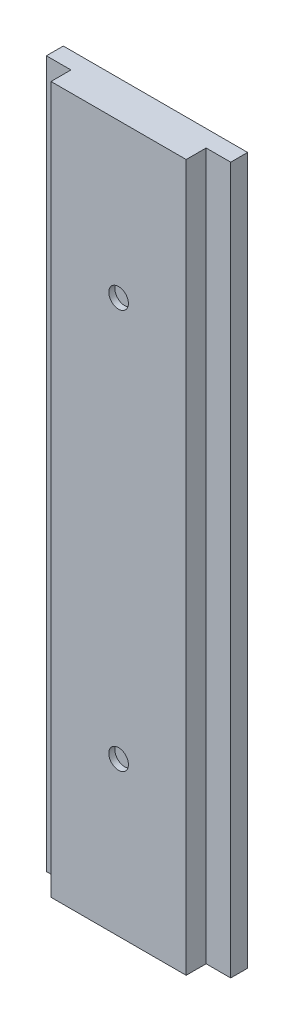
from build123d import *

# Parameters (mm, degrees)
ESQUISSE1_W             = 30
ESQUISSE1_H             = 115
EXTRUSION1_DEPTH        = 6
ESQUISSE2_W             = 4
ESQUISSE2_H             = 115
ENL_V_MAT_EXTRU_1_DEPTH = 3.25
ESQUISSE3_R             = 1.6
ENL_V_MAT_EXTRU_2_DEPTH = 1


with BuildPart() as part:
    # Esquisse1 → Extrusion1 (new body)
    with BuildSketch(Plane.XY):
        with Locations((35, -17.5)):
            Rectangle(ESQUISSE1_W, ESQUISSE1_H)
    extrude(amount=EXTRUSION1_DEPTH)

    # Esquisse2 → Enl_v. mat.-Extru.1 (cut)
    with BuildSketch(Plane.XY.offset(6)):
        with Locations((22, -17.5)):
            Rectangle(ESQUISSE2_W, ESQUISSE2_H)
        with Locations((48, -17.5)):
            Rectangle(ESQUISSE2_W, ESQUISSE2_H)
    extrude(amount=-ENL_V_MAT_EXTRU_1_DEPTH, mode=Mode.SUBTRACT)

    # Esquisse3 → Enl_v. mat.-Extru.2 (cut)
    with BuildSketch(Plane.XY.offset(6)):
        with Locations((35, 15)):
            Circle(ESQUISSE3_R)
        with Locations((35, -50)):
            Circle(ESQUISSE3_R)
    extrude(amount=-ENL_V_MAT_EXTRU_2_DEPTH, mode=Mode.SUBTRACT)


solid = part.part
